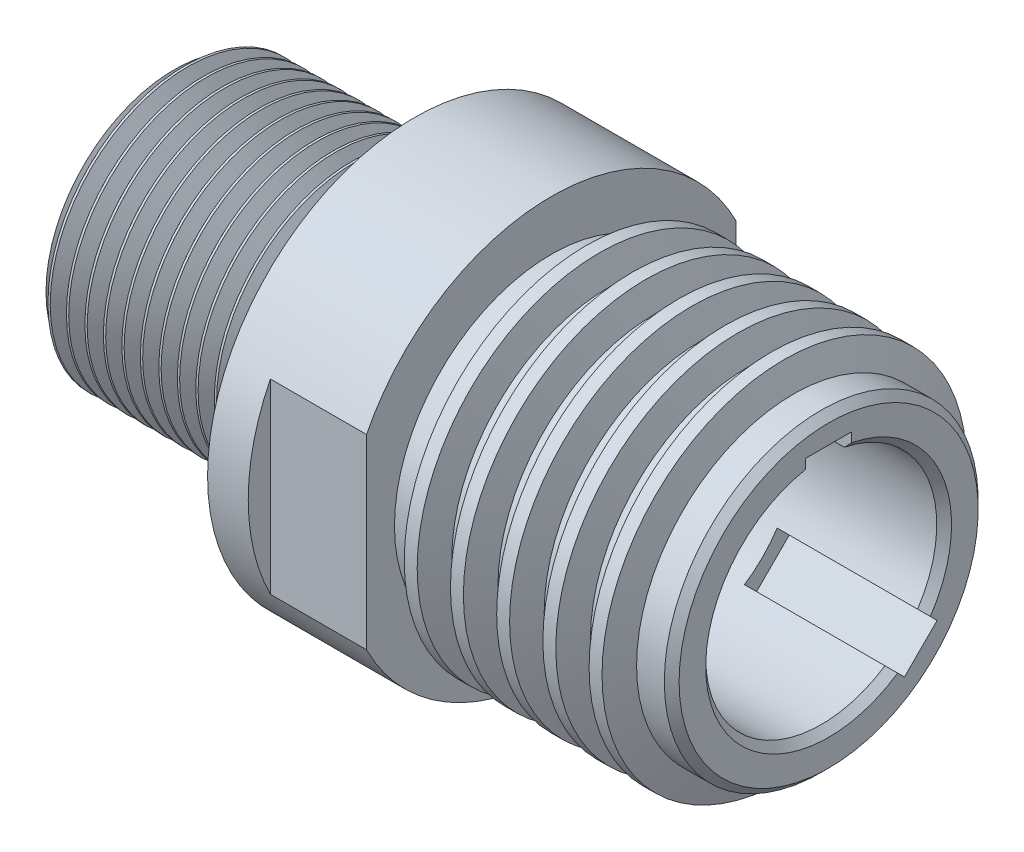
from build123d import *

# Parameters (mm, degrees)
SKETCH3_OUTSIDE_W       = 43.892
SKETCH3_OUTSIDE_H       = 43.892
SKETCH3_OUTSIDE_W_2     = 25.4
SKETCH3_OUTSIDE_H_2     = 37.067844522
CUT_EXTRUDE2_DEPTH      = 6.604
CHAMFER1_SIZE           = 0.508
SKETCH4_W               = 3.175
SKETCH4_H               = 3.082971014
CUT_EXTRUDE3_DEPTH      = 10.16
CUT_EXTRUDE4_DEPTH      = 62.861385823
CUT_EXTRUDE4_DEPTH_BACK = 62.861385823


with BuildPart() as part:
    # Sketch1 → Base-Revolve (revolve)
    with BuildSketch(Plane.XY, mode=Mode.PRIVATE) as base_revolve_sk:
        Polygon((0, 8.5725), (0.254, 8.5725), (0.752599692, 9.4361), (0.911349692, 9.4361), (1.409949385, 8.5725), (1.524, 8.5725), (2.022599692, 9.4361), (2.181349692, 9.4361), (2.679949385, 8.5725), (2.794, 8.5725), (3.292599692, 9.4361), (3.451349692, 9.4361), (3.949949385, 8.5725), (4.064, 8.5725), (4.562599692, 9.4361), (4.721349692, 9.4361), (5.219949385, 8.5725), (5.334, 8.5725), (5.832599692, 9.4361), (5.991349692, 9.4361), (6.489949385, 8.5725), (6.604, 8.5725), (7.102599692, 9.4361), (7.261349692, 9.4361), (7.759949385, 8.5725), (7.874, 8.5725), (8.372599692, 9.4361), (8.531349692, 9.4361), (9.029949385, 8.5725), (9.144, 8.5725), (9.642599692, 9.4361), (9.801349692, 9.4361), (10.299949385, 8.5725), (10.414, 8.5725), (10.912599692, 9.4361), (11.071349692, 9.4361), (11.569949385, 8.5725), (11.684, 8.5725), (12.182599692, 9.4361), (12.341349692, 9.4361), (12.839949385, 8.5725), (12.954, 8.5725), (13.452599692, 9.4361), (13.611349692, 9.4361), (14.109949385, 8.5725), (14.224, 8.5725), (14.722599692, 9.4361), (14.881349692, 9.4361), (15.379949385, 8.5725), (15.494, 8.5725), (15.992599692, 9.4361), (16.151349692, 9.4361), (16.649949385, 8.5725), (16.764, 8.5725), (17.262599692, 9.4361), (17.421349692, 9.4361), (17.919949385, 8.5725), (18.034, 8.5725), (18.532599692, 9.4361), (18.691349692, 9.4361), (19.189949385, 8.5725), (19.304, 8.5725), (19.802599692, 9.4361), (19.961349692, 9.4361), (20.459949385, 8.5725), (20.574, 8.5725), (21.072599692, 9.4361), (21.231349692, 9.4361), (21.729949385, 8.5725), (21.844, 8.5725), (25.4, 8.5725), (25.4, 10.16), (27.0002, 10.16), (27.0002, 11.9634), (25.4, 11.9634), (25.4, 14.224), (34.798, 14.224), (34.798, 10.7823), (36.576, 10.7823), (37.211, 12.5222), (38.1, 12.5222), (38.735, 10.7823), (39.751, 10.7823), (40.386, 12.5222), (41.275, 12.5222), (41.91, 10.7823), (42.926, 10.7823), (43.561, 12.5222), (44.45, 12.5222), (45.085, 10.7823), (46.101, 10.7823), (46.736, 12.5222), (47.625, 12.5222), (48.26, 10.7823), (49.276, 10.7823), (49.911, 12.5222), (50.8, 12.5222), (51.435, 10.7823), (52.451, 10.7823), (52.889487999, 10.7823), (53.848, 10.7823), (53.848, 7.9375), (31.536013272, 7.9375), (31.536013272, 5.972442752), (0, 5.972442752), align=None)
    revolve(base_revolve_sk.sketch.rotate(Axis((-0.860260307, 0, 0), (1, 0, 0)), 90), axis=Axis((-0.860260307, 0, 0), (1, 0, 0)))

    # Sketch3 outside → Cut-Extrude2 (cut)
    with BuildSketch(Plane(origin=(34.798, 0, 0), x_dir=(0, 0, -1), z_dir=(1, 0, 0))):
        Rectangle(SKETCH3_OUTSIDE_W, SKETCH3_OUTSIDE_H)
        Rectangle(SKETCH3_OUTSIDE_W_2, SKETCH3_OUTSIDE_H_2, mode=Mode.SUBTRACT)
    extrude(amount=-CUT_EXTRUDE2_DEPTH, mode=Mode.SUBTRACT)

    # Chamfer1
    chamfer1_edges = [part.edges().sort_by_distance(p)[0] for p in [
        (53.848, 0, -7.9375),
        (53.848, 0, -10.7823),
    ]]
    chamfer(chamfer1_edges, length=CHAMFER1_SIZE)

    # Sketch4 → Cut-Extrude3 (cut)
    with BuildSketch(Plane(origin=(53.848, 0, 0), x_dir=(0, 0, -1), z_dir=(1, 0, 0))):
        with Locations((0, 7.412014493)):
            Rectangle(SKETCH4_W, SKETCH4_H)
        Polygon((7.45361258, -5.20854855), (5.20854855, -7.45361258), (3.02855884, -5.27362287), (5.27362287, -3.02855884), align=None)
    extrude(amount=-CUT_EXTRUDE3_DEPTH, mode=Mode.SUBTRACT)

    # Sketch5 → Cut-Extrude4 (cut, two sides: drawn at the far end of the back side and taken through both)
    with BuildSketch(Plane(origin=(0, 0, -12.7), x_dir=(-1, 0, 0), z_dir=(0, 0, -1)).offset(-CUT_EXTRUDE4_DEPTH_BACK)):
        Polygon((-8.89, -155.621205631), (-8.89, -23.958566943), (-8.89, 26.754380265), (-8.89, 158.417018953), (254.435277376, 158.417018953), (254.435277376, -155.621205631), align=None)
    extrude(amount=CUT_EXTRUDE4_DEPTH + CUT_EXTRUDE4_DEPTH_BACK, mode=Mode.SUBTRACT)


solid = part.part
